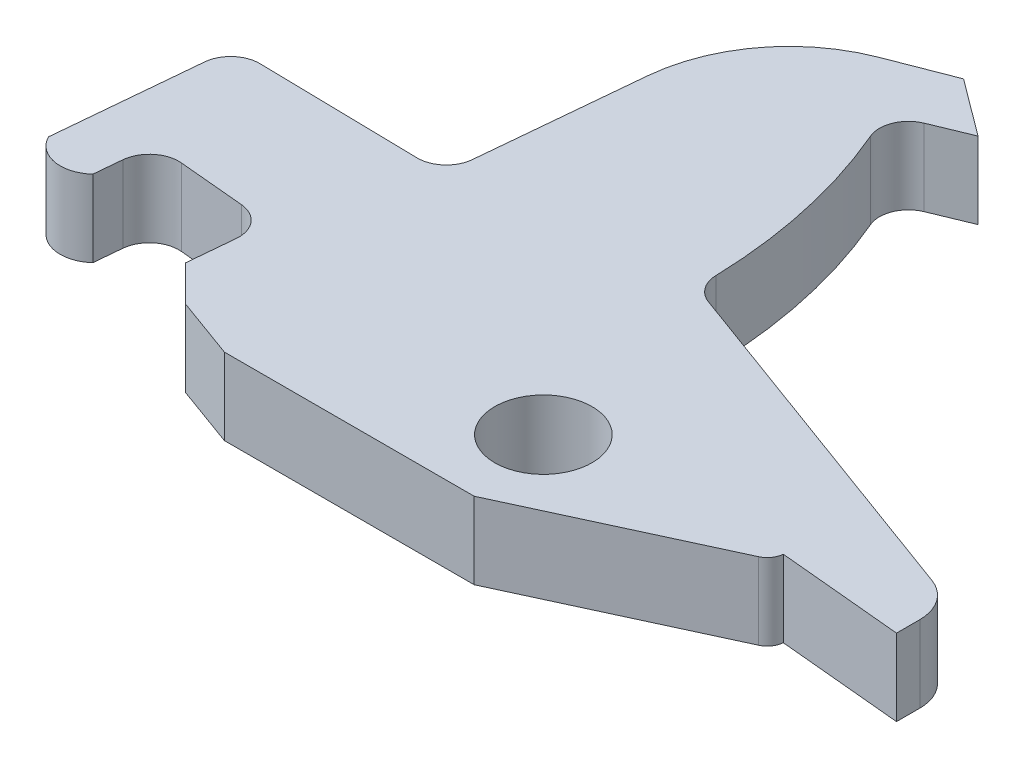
ISO-10303-21;
HEADER;
FILE_DESCRIPTION(('STEP AP214'),'2;1');
FILE_NAME('part.step','',(''),(''),'','','');
FILE_SCHEMA(('AUTOMOTIVE_DESIGN { 1 0 10303 214 1 1 1 1 }'));
ENDSEC;
DATA;
#1=APPLICATION_CONTEXT('core data for automotive mechanical design processes');
#2=APPLICATION_PROTOCOL_DEFINITION('international standard','automotive_design',2000,#1);
#3=PRODUCT_CONTEXT('',#1,'mechanical');
#4=PRODUCT('Part','Part','',(#3));
#5=PRODUCT_RELATED_PRODUCT_CATEGORY('part','',(#4));
#6=PRODUCT_DEFINITION_FORMATION('','',#4);
#7=PRODUCT_DEFINITION_CONTEXT('part definition',#1,'design');
#8=PRODUCT_DEFINITION('design','',#6,#7);
#9=PRODUCT_DEFINITION_SHAPE('','',#8);
#10=(LENGTH_UNIT() NAMED_UNIT(*) SI_UNIT(.MILLI.,.METRE.));
#11=(NAMED_UNIT(*) PLANE_ANGLE_UNIT() SI_UNIT($,.RADIAN.));
#12=(NAMED_UNIT(*) SI_UNIT($,.STERADIAN.) SOLID_ANGLE_UNIT());
#13=UNCERTAINTY_MEASURE_WITH_UNIT(LENGTH_MEASURE(1.E-05),#10,'distance_accuracy_value','');
#14=(GEOMETRIC_REPRESENTATION_CONTEXT(3) GLOBAL_UNCERTAINTY_ASSIGNED_CONTEXT((#13)) GLOBAL_UNIT_ASSIGNED_CONTEXT((#10,
#11,#12)) REPRESENTATION_CONTEXT('',''));
#15=CARTESIAN_POINT('',(0.,0.,0.));
#16=DIRECTION('',(0.,0.,1.));
#17=DIRECTION('',(1.,0.,0.));
#18=AXIS2_PLACEMENT_3D('',#15,#16,#17);
#19=CARTESIAN_POINT('',(33.2381306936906,-3.10575828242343,-4.73504927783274));
#20=DIRECTION('',(0.,1.,0.));
#21=DIRECTION('',(0.,0.,1.));
#22=AXIS2_PLACEMENT_3D('',#19,#20,#21);
#23=CYLINDRICAL_SURFACE('',#22,1.72591142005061);
#24=CARTESIAN_POINT('',(33.2381306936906,0.,-4.73504927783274));
#25=DIRECTION('',(0.,1.,0.));
#26=DIRECTION('',(0.,0.,1.));
#27=AXIS2_PLACEMENT_3D('',#24,#25,#26);
#28=CIRCLE('',#27,1.72591142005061);
#29=CARTESIAN_POINT('',(34.9640421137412,0.,-4.73504927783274));
#30=VERTEX_POINT('',#29);
#31=CARTESIAN_POINT('',(33.8326173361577,0.,-6.35534427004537));
#32=VERTEX_POINT('',#31);
#33=EDGE_CURVE('E245',#30,#32,#28,.T.);
#34=ORIENTED_EDGE('',*,*,#33,.F.);
#35=DIRECTION('',(0.,1.,0.));
#36=VECTOR('',#35,1.);
#37=CARTESIAN_POINT('',(34.9640421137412,-3.10575828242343,-4.73504927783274));
#38=LINE('',#37,#36);
#39=CARTESIAN_POINT('',(34.9640421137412,-3.10575828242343,-4.73504927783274));
#40=VERTEX_POINT('',#39);
#41=EDGE_CURVE('E11',#40,#30,#38,.T.);
#42=ORIENTED_EDGE('',*,*,#41,.F.);
#43=CARTESIAN_POINT('',(33.2381306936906,-3.10575828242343,-4.73504927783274));
#44=DIRECTION('',(0.,1.,0.));
#45=DIRECTION('',(0.,0.,1.));
#46=AXIS2_PLACEMENT_3D('',#43,#44,#45);
#47=CIRCLE('',#46,1.72591142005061);
#48=CARTESIAN_POINT('',(33.8326173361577,-3.10575828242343,-6.35534427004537));
#49=VERTEX_POINT('',#48);
#50=EDGE_CURVE('E323',#40,#49,#47,.T.);
#51=ORIENTED_EDGE('',*,*,#50,.T.);
#52=DIRECTION('',(0.,1.,0.));
#53=VECTOR('',#52,1.);
#54=CARTESIAN_POINT('',(33.8326173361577,-3.10575828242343,-6.35534427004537));
#55=LINE('',#54,#53);
#56=EDGE_CURVE('E37',#49,#32,#55,.T.);
#57=ORIENTED_EDGE('',*,*,#56,.T.);
#58=EDGE_LOOP('',(#34,#42,#51,#57));
#59=FACE_BOUND('',#58,.T.);
#60=ADVANCED_FACE('F34',(#59),#23,.T.);
#61=CARTESIAN_POINT('',(34.9640421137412,-3.10575828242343,-4.73504927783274));
#62=DIRECTION('',(1.,0.,0.));
#63=DIRECTION('',(0.,0.,-1.));
#64=AXIS2_PLACEMENT_3D('',#61,#62,#63);
#65=PLANE('',#64);
#66=DIRECTION('',(0.,0.,-1.));
#67=VECTOR('',#66,1.);
#68=CARTESIAN_POINT('',(34.9640421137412,0.,-4.73504927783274));
#69=LINE('',#68,#67);
#70=CARTESIAN_POINT('',(34.9640421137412,0.,-3.78792750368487));
#71=VERTEX_POINT('',#70);
#72=EDGE_CURVE('E321',#71,#30,#69,.T.);
#73=ORIENTED_EDGE('',*,*,#72,.F.);
#74=DIRECTION('',(0.,1.,0.));
#75=VECTOR('',#74,1.);
#76=CARTESIAN_POINT('',(34.9640421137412,-3.10575828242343,-3.78792750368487));
#77=LINE('',#76,#75);
#78=CARTESIAN_POINT('',(34.9640421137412,-3.10575828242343,-3.78792750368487));
#79=VERTEX_POINT('',#78);
#80=EDGE_CURVE('E43',#79,#71,#77,.T.);
#81=ORIENTED_EDGE('',*,*,#80,.F.);
#82=DIRECTION('',(0.,0.,-1.));
#83=VECTOR('',#82,1.);
#84=CARTESIAN_POINT('',(34.9640421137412,-3.10575828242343,-4.73504927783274));
#85=LINE('',#84,#83);
#86=EDGE_CURVE('E235',#79,#40,#85,.T.);
#87=ORIENTED_EDGE('',*,*,#86,.T.);
#88=ORIENTED_EDGE('',*,*,#41,.T.);
#89=EDGE_LOOP('',(#73,#81,#87,#88));
#90=FACE_BOUND('',#89,.T.);
#91=ADVANCED_FACE('F373',(#90),#65,.T.);
#92=CARTESIAN_POINT('',(29.906313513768,-3.10575828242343,-4.26309211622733));
#93=DIRECTION('',(-0.0935363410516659,0.,0.995615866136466));
#94=DIRECTION('',(0.995615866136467,0.,0.0935363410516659));
#95=AXIS2_PLACEMENT_3D('',#92,#93,#94);
#96=PLANE('',#95);
#97=DIRECTION('',(0.995615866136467,0.,0.0935363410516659));
#98=VECTOR('',#97,1.);
#99=CARTESIAN_POINT('',(29.906313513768,0.,-4.26309211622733));
#100=LINE('',#99,#98);
#101=CARTESIAN_POINT('',(29.906313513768,0.,-4.26309211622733));
#102=VERTEX_POINT('',#101);
#103=EDGE_CURVE('E222',#102,#71,#100,.T.);
#104=ORIENTED_EDGE('',*,*,#103,.F.);
#105=DIRECTION('',(0.,1.,0.));
#106=VECTOR('',#105,1.);
#107=CARTESIAN_POINT('',(29.906313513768,-3.10575828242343,-4.26309211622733));
#108=LINE('',#107,#106);
#109=CARTESIAN_POINT('',(29.906313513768,-3.10575828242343,-4.26309211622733));
#110=VERTEX_POINT('',#109);
#111=EDGE_CURVE('E217',#110,#102,#108,.T.);
#112=ORIENTED_EDGE('',*,*,#111,.F.);
#113=DIRECTION('',(0.995615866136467,0.,0.0935363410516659));
#114=VECTOR('',#113,1.);
#115=CARTESIAN_POINT('',(29.906313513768,-3.10575828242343,-4.26309211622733));
#116=LINE('',#115,#114);
#117=EDGE_CURVE('E220',#110,#79,#116,.T.);
#118=ORIENTED_EDGE('',*,*,#117,.T.);
#119=ORIENTED_EDGE('',*,*,#80,.T.);
#120=EDGE_LOOP('',(#104,#112,#118,#119));
#121=FACE_BOUND('',#120,.T.);
#122=ADVANCED_FACE('F219',(#121),#96,.T.);
#123=CARTESIAN_POINT('',(29.1876126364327,-3.10575828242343,-4.33061278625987));
#124=DIRECTION('',(0.,1.,0.));
#125=DIRECTION('',(0.,0.,1.));
#126=AXIS2_PLACEMENT_3D('',#123,#124,#125);
#127=CYLINDRICAL_SURFACE('',#126,0.721865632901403);
#128=CARTESIAN_POINT('',(29.1876126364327,0.,-4.33061278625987));
#129=DIRECTION('',(0.,1.,0.));
#130=DIRECTION('',(0.,0.,-1.));
#131=AXIS2_PLACEMENT_3D('',#128,#129,#130);
#132=CIRCLE('',#131,0.721865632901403);
#133=CARTESIAN_POINT('',(29.490163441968,0.,-3.67520985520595));
#134=VERTEX_POINT('',#133);
#135=EDGE_CURVE('E318',#134,#102,#132,.T.);
#136=ORIENTED_EDGE('',*,*,#135,.F.);
#137=DIRECTION('',(0.,1.,0.));
#138=VECTOR('',#137,1.);
#139=CARTESIAN_POINT('',(29.490163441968,-3.10575828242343,-3.67520985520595));
#140=LINE('',#139,#138);
#141=CARTESIAN_POINT('',(29.490163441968,-3.10575828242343,-3.67520985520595));
#142=VERTEX_POINT('',#141);
#143=EDGE_CURVE('E227',#142,#134,#140,.T.);
#144=ORIENTED_EDGE('',*,*,#143,.F.);
#145=CARTESIAN_POINT('',(29.1876126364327,-3.10575828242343,-4.33061278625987));
#146=DIRECTION('',(0.,1.,0.));
#147=DIRECTION('',(0.,0.,-1.));
#148=AXIS2_PLACEMENT_3D('',#145,#146,#147);
#149=CIRCLE('',#148,0.721865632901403);
#150=EDGE_CURVE('E233',#142,#110,#149,.T.);
#151=ORIENTED_EDGE('',*,*,#150,.T.);
#152=ORIENTED_EDGE('',*,*,#111,.T.);
#153=EDGE_LOOP('',(#136,#144,#151,#152));
#154=FACE_BOUND('',#153,.T.);
#155=ADVANCED_FACE('F237',(#154),#127,.T.);
#156=CARTESIAN_POINT('',(29.490163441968,-3.10575828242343,-3.67520985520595));
#157=DIRECTION('',(0.419123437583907,0.,0.907929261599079));
#158=DIRECTION('',(0.907929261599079,0.,-0.419123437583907));
#159=AXIS2_PLACEMENT_3D('',#156,#157,#158);
#160=PLANE('',#159);
#161=DIRECTION('',(0.907929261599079,0.,-0.419123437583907));
#162=VECTOR('',#161,1.);
#163=CARTESIAN_POINT('',(29.490163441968,0.,-3.67520985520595));
#164=LINE('',#163,#162);
#165=CARTESIAN_POINT('',(21.608505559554,0.,-0.0368343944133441));
#166=VERTEX_POINT('',#165);
#167=EDGE_CURVE('E315',#166,#134,#164,.T.);
#168=ORIENTED_EDGE('',*,*,#167,.F.);
#169=DIRECTION('',(0.,1.,0.));
#170=VECTOR('',#169,1.);
#171=CARTESIAN_POINT('',(21.608505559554,-3.10575828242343,-0.0368343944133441));
#172=LINE('',#171,#170);
#173=CARTESIAN_POINT('',(21.608505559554,-3.10575828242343,-0.0368343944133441));
#174=VERTEX_POINT('',#173);
#175=EDGE_CURVE('E327',#174,#166,#172,.T.);
#176=ORIENTED_EDGE('',*,*,#175,.F.);
#177=DIRECTION('',(0.907929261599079,0.,-0.419123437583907));
#178=VECTOR('',#177,1.);
#179=CARTESIAN_POINT('',(29.490163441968,-3.10575828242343,-3.67520985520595));
#180=LINE('',#179,#178);
#181=EDGE_CURVE('E238',#174,#142,#180,.T.);
#182=ORIENTED_EDGE('',*,*,#181,.T.);
#183=ORIENTED_EDGE('',*,*,#143,.T.);
#184=EDGE_LOOP('',(#168,#176,#182,#183));
#185=FACE_BOUND('',#184,.T.);
#186=ADVANCED_FACE('F386',(#185),#160,.T.);
#187=CARTESIAN_POINT('',(11.4950564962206,-3.10575828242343,-0.0347412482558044));
#188=DIRECTION('',(0.000206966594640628,0.,0.999999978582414));
#189=DIRECTION('',(0.999999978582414,0.,-0.000206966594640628));
#190=AXIS2_PLACEMENT_3D('',#187,#188,#189);
#191=PLANE('',#190);
#192=DIRECTION('',(0.999999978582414,0.,-0.000206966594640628));
#193=VECTOR('',#192,1.);
#194=CARTESIAN_POINT('',(11.4950564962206,0.,-0.0347412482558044));
#195=LINE('',#194,#193);
#196=CARTESIAN_POINT('',(11.4950564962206,0.,-0.0347412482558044));
#197=VERTEX_POINT('',#196);
#198=EDGE_CURVE('E312',#197,#166,#195,.T.);
#199=ORIENTED_EDGE('',*,*,#198,.F.);
#200=DIRECTION('',(0.,1.,0.));
#201=VECTOR('',#200,1.);
#202=CARTESIAN_POINT('',(11.4950564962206,-3.10575828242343,-0.0347412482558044));
#203=LINE('',#202,#201);
#204=CARTESIAN_POINT('',(11.4950564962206,-3.10575828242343,-0.0347412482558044));
#205=VERTEX_POINT('',#204);
#206=EDGE_CURVE('E329',#205,#197,#203,.T.);
#207=ORIENTED_EDGE('',*,*,#206,.F.);
#208=DIRECTION('',(0.999999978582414,0.,-0.000206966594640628));
#209=VECTOR('',#208,1.);
#210=CARTESIAN_POINT('',(11.4950564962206,-3.10575828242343,-0.0347412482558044));
#211=LINE('',#210,#209);
#212=EDGE_CURVE('E240',#205,#174,#211,.T.);
#213=ORIENTED_EDGE('',*,*,#212,.T.);
#214=ORIENTED_EDGE('',*,*,#175,.T.);
#215=EDGE_LOOP('',(#199,#207,#213,#214));
#216=FACE_BOUND('',#215,.T.);
#217=ADVANCED_FACE('F389',(#216),#191,.T.);
#218=CARTESIAN_POINT('',(9.02702691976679,-3.10575828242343,-0.932452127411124));
#219=DIRECTION('',(-0.34182565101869,0.,0.939763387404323));
#220=DIRECTION('',(0.939763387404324,0.,0.34182565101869));
#221=AXIS2_PLACEMENT_3D('',#218,#219,#220);
#222=PLANE('',#221);
#223=DIRECTION('',(0.939763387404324,0.,0.34182565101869));
#224=VECTOR('',#223,1.);
#225=CARTESIAN_POINT('',(9.02702691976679,0.,-0.932452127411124));
#226=LINE('',#225,#224);
#227=CARTESIAN_POINT('',(9.02702691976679,0.,-0.932452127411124));
#228=VERTEX_POINT('',#227);
#229=EDGE_CURVE('E309',#228,#197,#226,.T.);
#230=ORIENTED_EDGE('',*,*,#229,.F.);
#231=DIRECTION('',(0.,1.,0.));
#232=VECTOR('',#231,1.);
#233=CARTESIAN_POINT('',(9.02702691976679,-3.10575828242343,-0.932452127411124));
#234=LINE('',#233,#232);
#235=CARTESIAN_POINT('',(9.02702691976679,-3.10575828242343,-0.932452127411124));
#236=VERTEX_POINT('',#235);
#237=EDGE_CURVE('E331',#236,#228,#234,.T.);
#238=ORIENTED_EDGE('',*,*,#237,.F.);
#239=DIRECTION('',(0.939763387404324,0.,0.34182565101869));
#240=VECTOR('',#239,1.);
#241=CARTESIAN_POINT('',(9.02702691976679,-3.10575828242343,-0.932452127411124));
#242=LINE('',#241,#240);
#243=EDGE_CURVE('E557',#236,#205,#242,.T.);
#244=ORIENTED_EDGE('',*,*,#243,.T.);
#245=ORIENTED_EDGE('',*,*,#206,.T.);
#246=EDGE_LOOP('',(#230,#238,#244,#245));
#247=FACE_BOUND('',#246,.T.);
#248=ADVANCED_FACE('F393',(#247),#222,.T.);
#249=CARTESIAN_POINT('',(9.02702691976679,-3.10575828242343,-0.932452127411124));
#250=DIRECTION('',(-0.706960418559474,0.,0.707253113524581));
#251=DIRECTION('',(0.707253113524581,0.,0.706960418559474));
#252=AXIS2_PLACEMENT_3D('',#249,#250,#251);
#253=PLANE('',#252);
#254=DIRECTION('',(0.707253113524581,0.,0.706960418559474));
#255=VECTOR('',#254,1.);
#256=CARTESIAN_POINT('',(9.02702691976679,0.,-0.932452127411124));
#257=LINE('',#256,#255);
#258=CARTESIAN_POINT('',(7.57895490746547,0.,-2.3799248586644));
#259=VERTEX_POINT('',#258);
#260=EDGE_CURVE('E306',#259,#228,#257,.T.);
#261=ORIENTED_EDGE('',*,*,#260,.F.);
#262=DIRECTION('',(0.,1.,0.));
#263=VECTOR('',#262,1.);
#264=CARTESIAN_POINT('',(7.57895490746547,-3.10575828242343,-2.3799248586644));
#265=LINE('',#264,#263);
#266=CARTESIAN_POINT('',(7.57895490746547,-3.10575828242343,-2.3799248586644));
#267=VERTEX_POINT('',#266);
#268=EDGE_CURVE('E333',#267,#259,#265,.T.);
#269=ORIENTED_EDGE('',*,*,#268,.F.);
#270=DIRECTION('',(0.707253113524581,0.,0.706960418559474));
#271=VECTOR('',#270,1.);
#272=CARTESIAN_POINT('',(9.02702691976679,-3.10575828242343,-0.932452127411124));
#273=LINE('',#272,#271);
#274=EDGE_CURVE('E554',#267,#236,#273,.T.);
#275=ORIENTED_EDGE('',*,*,#274,.T.);
#276=ORIENTED_EDGE('',*,*,#237,.T.);
#277=EDGE_LOOP('',(#261,#269,#275,#276));
#278=FACE_BOUND('',#277,.T.);
#279=ADVANCED_FACE('F397',(#278),#253,.T.);
#280=CARTESIAN_POINT('',(7.751897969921,-3.10575828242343,-4.25643788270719));
#281=DIRECTION('',(-0.995779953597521,0.,-0.0917730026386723));
#282=DIRECTION('',(-0.0917730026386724,0.,0.995779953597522));
#283=AXIS2_PLACEMENT_3D('',#280,#281,#282);
#284=PLANE('',#283);
#285=DIRECTION('',(-0.0917730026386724,0.,0.995779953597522));
#286=VECTOR('',#285,1.);
#287=CARTESIAN_POINT('',(7.751897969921,0.,-4.25643788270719));
#288=LINE('',#287,#286);
#289=CARTESIAN_POINT('',(7.751897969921,0.,-4.25643788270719));
#290=VERTEX_POINT('',#289);
#291=EDGE_CURVE('E303',#290,#259,#288,.T.);
#292=ORIENTED_EDGE('',*,*,#291,.F.);
#293=DIRECTION('',(0.,1.,0.));
#294=VECTOR('',#293,1.);
#295=CARTESIAN_POINT('',(7.751897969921,-3.10575828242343,-4.25643788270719));
#296=LINE('',#295,#294);
#297=CARTESIAN_POINT('',(7.751897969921,-3.10575828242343,-4.25643788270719));
#298=VERTEX_POINT('',#297);
#299=EDGE_CURVE('E335',#298,#290,#296,.T.);
#300=ORIENTED_EDGE('',*,*,#299,.F.);
#301=DIRECTION('',(-0.0917730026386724,0.,0.995779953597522));
#302=VECTOR('',#301,1.);
#303=CARTESIAN_POINT('',(7.751897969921,-3.10575828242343,-4.25643788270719));
#304=LINE('',#303,#302);
#305=EDGE_CURVE('E551',#298,#267,#304,.T.);
#306=ORIENTED_EDGE('',*,*,#305,.T.);
#307=ORIENTED_EDGE('',*,*,#268,.T.);
#308=EDGE_LOOP('',(#292,#300,#306,#307));
#309=FACE_BOUND('',#308,.T.);
#310=ADVANCED_FACE('F401',(#309),#284,.T.);
#311=CARTESIAN_POINT('',(6.56629746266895,-3.10575828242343,-4.36570511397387));
#312=DIRECTION('',(0.,1.,0.));
#313=DIRECTION('',(0.,0.,1.));
#314=AXIS2_PLACEMENT_3D('',#311,#312,#313);
#315=CYLINDRICAL_SURFACE('',#314,1.190625);
#316=CARTESIAN_POINT('',(6.56629746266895,0.,-4.36570511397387));
#317=DIRECTION('',(0.,-1.,0.));
#318=DIRECTION('',(0.,0.,-1.));
#319=AXIS2_PLACEMENT_3D('',#316,#317,#318);
#320=CIRCLE('',#319,1.190625);
#321=CARTESIAN_POINT('',(6.67556469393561,0.,-5.55130562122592));
#322=VERTEX_POINT('',#321);
#323=EDGE_CURVE('E300',#322,#290,#320,.T.);
#324=ORIENTED_EDGE('',*,*,#323,.F.);
#325=DIRECTION('',(0.,1.,0.));
#326=VECTOR('',#325,1.);
#327=CARTESIAN_POINT('',(6.67556469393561,-3.10575828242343,-5.55130562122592));
#328=LINE('',#327,#326);
#329=CARTESIAN_POINT('',(6.67556469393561,-3.10575828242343,-5.55130562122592));
#330=VERTEX_POINT('',#329);
#331=EDGE_CURVE('E337',#330,#322,#328,.T.);
#332=ORIENTED_EDGE('',*,*,#331,.F.);
#333=CARTESIAN_POINT('',(6.56629746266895,-3.10575828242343,-4.36570511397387));
#334=DIRECTION('',(0.,-1.,0.));
#335=DIRECTION('',(0.,0.,-1.));
#336=AXIS2_PLACEMENT_3D('',#333,#334,#335);
#337=CIRCLE('',#336,1.190625);
#338=EDGE_CURVE('E548',#330,#298,#337,.T.);
#339=ORIENTED_EDGE('',*,*,#338,.T.);
#340=ORIENTED_EDGE('',*,*,#299,.T.);
#341=EDGE_LOOP('',(#324,#332,#339,#340));
#342=FACE_BOUND('',#341,.T.);
#343=ADVANCED_FACE('F405',(#342),#315,.F.);
#344=CARTESIAN_POINT('',(3.98820354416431,-3.10575828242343,-5.79897801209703));
#345=DIRECTION('',(-0.0917730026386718,0.,0.995779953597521));
#346=DIRECTION('',(0.995779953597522,0.,0.0917730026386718));
#347=AXIS2_PLACEMENT_3D('',#344,#345,#346);
#348=PLANE('',#347);
#349=DIRECTION('',(0.995779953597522,0.,0.0917730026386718));
#350=VECTOR('',#349,1.);
#351=CARTESIAN_POINT('',(3.98820354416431,0.,-5.79897801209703));
#352=LINE('',#351,#350);
#353=CARTESIAN_POINT('',(3.98820354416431,0.,-5.79897801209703));
#354=VERTEX_POINT('',#353);
#355=EDGE_CURVE('E297',#354,#322,#352,.T.);
#356=ORIENTED_EDGE('',*,*,#355,.F.);
#357=DIRECTION('',(0.,1.,0.));
#358=VECTOR('',#357,1.);
#359=CARTESIAN_POINT('',(3.98820354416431,-3.10575828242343,-5.79897801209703));
#360=LINE('',#359,#358);
#361=CARTESIAN_POINT('',(3.98820354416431,-3.10575828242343,-5.79897801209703));
#362=VERTEX_POINT('',#361);
#363=EDGE_CURVE('E339',#362,#354,#360,.T.);
#364=ORIENTED_EDGE('',*,*,#363,.F.);
#365=DIRECTION('',(0.995779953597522,0.,0.0917730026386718));
#366=VECTOR('',#365,1.);
#367=CARTESIAN_POINT('',(3.98820354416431,-3.10575828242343,-5.79897801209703));
#368=LINE('',#367,#366);
#369=EDGE_CURVE('E545',#362,#330,#368,.T.);
#370=ORIENTED_EDGE('',*,*,#369,.T.);
#371=ORIENTED_EDGE('',*,*,#331,.T.);
#372=EDGE_LOOP('',(#356,#364,#370,#371));
#373=FACE_BOUND('',#372,.T.);
#374=ADVANCED_FACE('F409',(#373),#348,.T.);
#375=CARTESIAN_POINT('',(3.87893631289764,-3.10575828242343,-4.61337750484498));
#376=DIRECTION('',(0.,1.,0.));
#377=DIRECTION('',(0.,0.,1.));
#378=AXIS2_PLACEMENT_3D('',#375,#376,#377);
#379=CYLINDRICAL_SURFACE('',#378,1.190625);
#380=CARTESIAN_POINT('',(3.87893631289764,0.,-4.61337750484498));
#381=DIRECTION('',(0.,-1.,0.));
#382=DIRECTION('',(0.,0.,-1.));
#383=AXIS2_PLACEMENT_3D('',#380,#381,#382);
#384=CIRCLE('',#383,1.190625);
#385=CARTESIAN_POINT('',(2.69333580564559,0.,-4.72264473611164));
#386=VERTEX_POINT('',#385);
#387=EDGE_CURVE('E294',#386,#354,#384,.T.);
#388=ORIENTED_EDGE('',*,*,#387,.F.);
#389=DIRECTION('',(0.,1.,0.));
#390=VECTOR('',#389,1.);
#391=CARTESIAN_POINT('',(2.69333580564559,-3.10575828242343,-4.72264473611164));
#392=LINE('',#391,#390);
#393=CARTESIAN_POINT('',(2.69333580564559,-3.10575828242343,-4.72264473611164));
#394=VERTEX_POINT('',#393);
#395=EDGE_CURVE('E341',#394,#386,#392,.T.);
#396=ORIENTED_EDGE('',*,*,#395,.F.);
#397=CARTESIAN_POINT('',(3.87893631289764,-3.10575828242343,-4.61337750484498));
#398=DIRECTION('',(0.,-1.,0.));
#399=DIRECTION('',(0.,0.,-1.));
#400=AXIS2_PLACEMENT_3D('',#397,#398,#399);
#401=CIRCLE('',#400,1.190625);
#402=EDGE_CURVE('E542',#394,#362,#401,.T.);
#403=ORIENTED_EDGE('',*,*,#402,.T.);
#404=ORIENTED_EDGE('',*,*,#363,.T.);
#405=EDGE_LOOP('',(#388,#396,#403,#404));
#406=FACE_BOUND('',#405,.T.);
#407=ADVANCED_FACE('F413',(#406),#379,.F.);
#408=CARTESIAN_POINT('',(2.69333580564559,-3.10575828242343,-4.72264473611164));
#409=DIRECTION('',(0.995779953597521,0.,0.0917730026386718));
#410=DIRECTION('',(0.0917730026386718,0.,-0.995779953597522));
#411=AXIS2_PLACEMENT_3D('',#408,#409,#410);
#412=PLANE('',#411);
#413=DIRECTION('',(0.0917730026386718,0.,-0.995779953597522));
#414=VECTOR('',#413,1.);
#415=CARTESIAN_POINT('',(2.69333580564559,0.,-4.72264473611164));
#416=LINE('',#415,#414);
#417=CARTESIAN_POINT('',(2.59118248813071,0.,-3.61423351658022));
#418=VERTEX_POINT('',#417);
#419=EDGE_CURVE('E291',#418,#386,#416,.T.);
#420=ORIENTED_EDGE('',*,*,#419,.F.);
#421=DIRECTION('',(0.,1.,0.));
#422=VECTOR('',#421,1.);
#423=CARTESIAN_POINT('',(2.59118248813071,-3.10575828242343,-3.61423351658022));
#424=LINE('',#423,#422);
#425=CARTESIAN_POINT('',(2.59118248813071,-3.10575828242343,-3.61423351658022));
#426=VERTEX_POINT('',#425);
#427=EDGE_CURVE('E343',#426,#418,#424,.T.);
#428=ORIENTED_EDGE('',*,*,#427,.F.);
#429=DIRECTION('',(0.0917730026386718,0.,-0.995779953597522));
#430=VECTOR('',#429,1.);
#431=CARTESIAN_POINT('',(2.69333580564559,-3.10575828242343,-4.72264473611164));
#432=LINE('',#431,#430);
#433=EDGE_CURVE('E539',#426,#394,#432,.T.);
#434=ORIENTED_EDGE('',*,*,#433,.T.);
#435=ORIENTED_EDGE('',*,*,#395,.T.);
#436=EDGE_LOOP('',(#420,#428,#434,#435));
#437=FACE_BOUND('',#436,.T.);
#438=ADVANCED_FACE('F417',(#437),#412,.T.);
#439=CARTESIAN_POINT('',(1.64081354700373,-3.10575828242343,-4.63721937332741));
#440=DIRECTION('',(0.,1.,0.));
#441=DIRECTION('',(0.,0.,1.));
#442=AXIS2_PLACEMENT_3D('',#439,#440,#441);
#443=CYLINDRICAL_SURFACE('',#442,1.39631700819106);
#444=CARTESIAN_POINT('',(1.64081354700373,0.,-4.63721937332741));
#445=DIRECTION('',(0.,1.,0.));
#446=DIRECTION('',(0.,0.,-1.));
#447=AXIS2_PLACEMENT_3D('',#444,#445,#446);
#448=CIRCLE('',#447,1.39631700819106);
#449=CARTESIAN_POINT('',(0.384605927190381,0.,-4.02759358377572));
#450=VERTEX_POINT('',#449);
#451=EDGE_CURVE('E288',#450,#418,#448,.T.);
#452=ORIENTED_EDGE('',*,*,#451,.F.);
#453=DIRECTION('',(0.,1.,0.));
#454=VECTOR('',#453,1.);
#455=CARTESIAN_POINT('',(0.384605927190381,-3.10575828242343,-4.02759358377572));
#456=LINE('',#455,#454);
#457=CARTESIAN_POINT('',(0.384605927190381,-3.10575828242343,-4.02759358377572));
#458=VERTEX_POINT('',#457);
#459=EDGE_CURVE('E345',#458,#450,#456,.T.);
#460=ORIENTED_EDGE('',*,*,#459,.F.);
#461=CARTESIAN_POINT('',(1.64081354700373,-3.10575828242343,-4.63721937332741));
#462=DIRECTION('',(0.,1.,0.));
#463=DIRECTION('',(0.,0.,-1.));
#464=AXIS2_PLACEMENT_3D('',#461,#462,#463);
#465=CIRCLE('',#464,1.39631700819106);
#466=EDGE_CURVE('E536',#458,#426,#465,.T.);
#467=ORIENTED_EDGE('',*,*,#466,.T.);
#468=ORIENTED_EDGE('',*,*,#427,.T.);
#469=EDGE_LOOP('',(#452,#460,#467,#468));
#470=FACE_BOUND('',#469,.T.);
#471=ADVANCED_FACE('F421',(#470),#443,.T.);
#472=CARTESIAN_POINT('',(0.917649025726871,-3.10575828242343,-9.81136023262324));
#473=DIRECTION('',(-0.995779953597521,0.,-0.0917730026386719));
#474=DIRECTION('',(-0.0917730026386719,0.,0.995779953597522));
#475=AXIS2_PLACEMENT_3D('',#472,#473,#474);
#476=PLANE('',#475);
#477=DIRECTION('',(-0.0917730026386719,0.,0.995779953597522));
#478=VECTOR('',#477,1.);
#479=CARTESIAN_POINT('',(0.917649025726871,0.,-9.81136023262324));
#480=LINE('',#479,#478);
#481=CARTESIAN_POINT('',(0.917649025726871,0.,-9.81136023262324));
#482=VERTEX_POINT('',#481);
#483=EDGE_CURVE('E285',#482,#450,#480,.T.);
#484=ORIENTED_EDGE('',*,*,#483,.F.);
#485=DIRECTION('',(0.,1.,0.));
#486=VECTOR('',#485,1.);
#487=CARTESIAN_POINT('',(0.917649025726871,-3.10575828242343,-9.81136023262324));
#488=LINE('',#487,#486);
#489=CARTESIAN_POINT('',(0.917649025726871,-3.10575828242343,-9.81136023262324));
#490=VERTEX_POINT('',#489);
#491=EDGE_CURVE('E347',#490,#482,#488,.T.);
#492=ORIENTED_EDGE('',*,*,#491,.F.);
#493=DIRECTION('',(-0.0917730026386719,0.,0.995779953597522));
#494=VECTOR('',#493,1.);
#495=CARTESIAN_POINT('',(0.917649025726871,-3.10575828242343,-9.81136023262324));
#496=LINE('',#495,#494);
#497=EDGE_CURVE('E533',#490,#458,#496,.T.);
#498=ORIENTED_EDGE('',*,*,#497,.T.);
#499=ORIENTED_EDGE('',*,*,#459,.T.);
#500=EDGE_LOOP('',(#484,#492,#498,#499));
#501=FACE_BOUND('',#500,.T.);
#502=ADVANCED_FACE('F425',(#501),#476,.T.);
#503=CARTESIAN_POINT('',(2.08111832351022,-3.10575828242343,-9.70413265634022));
#504=DIRECTION('',(0.,1.,0.));
#505=DIRECTION('',(0.,0.,1.));
#506=AXIS2_PLACEMENT_3D('',#503,#504,#505);
#507=CYLINDRICAL_SURFACE('',#506,1.1684);
#508=CARTESIAN_POINT('',(2.08111832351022,0.,-9.70413265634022));
#509=DIRECTION('',(0.,1.,0.));
#510=DIRECTION('',(0.,0.,1.));
#511=AXIS2_PLACEMENT_3D('',#508,#509,#510);
#512=CIRCLE('',#511,1.1684);
#513=CARTESIAN_POINT('',(2.10367290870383,0.,-10.8723149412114));
#514=VERTEX_POINT('',#513);
#515=EDGE_CURVE('E282',#514,#482,#512,.T.);
#516=ORIENTED_EDGE('',*,*,#515,.F.);
#517=DIRECTION('',(0.,1.,0.));
#518=VECTOR('',#517,1.);
#519=CARTESIAN_POINT('',(2.10367290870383,-3.10575828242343,-10.8723149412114));
#520=LINE('',#519,#518);
#521=CARTESIAN_POINT('',(2.10367290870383,-3.10575828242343,-10.8723149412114));
#522=VERTEX_POINT('',#521);
#523=EDGE_CURVE('E349',#522,#514,#520,.T.);
#524=ORIENTED_EDGE('',*,*,#523,.F.);
#525=CARTESIAN_POINT('',(2.08111832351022,-3.10575828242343,-9.70413265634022));
#526=DIRECTION('',(0.,1.,0.));
#527=DIRECTION('',(0.,0.,1.));
#528=AXIS2_PLACEMENT_3D('',#525,#526,#527);
#529=CIRCLE('',#528,1.1684);
#530=EDGE_CURVE('E530',#522,#490,#529,.T.);
#531=ORIENTED_EDGE('',*,*,#530,.T.);
#532=ORIENTED_EDGE('',*,*,#491,.T.);
#533=EDGE_LOOP('',(#516,#524,#531,#532));
#534=FACE_BOUND('',#533,.T.);
#535=ADVANCED_FACE('F429',(#534),#507,.T.);
#536=CARTESIAN_POINT('',(8.57927253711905,-3.10575828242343,-10.7472878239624));
#537=DIRECTION('',(0.0193038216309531,0.,-0.999813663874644));
#538=DIRECTION('',(-0.999813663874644,0.,-0.0193038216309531));
#539=AXIS2_PLACEMENT_3D('',#536,#537,#538);
#540=PLANE('',#539);
#541=DIRECTION('',(-0.999813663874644,0.,-0.0193038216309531));
#542=VECTOR('',#541,1.);
#543=CARTESIAN_POINT('',(8.57927253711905,0.,-10.7472878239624));
#544=LINE('',#543,#542);
#545=CARTESIAN_POINT('',(8.57927253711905,0.,-10.7472878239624));
#546=VERTEX_POINT('',#545);
#547=EDGE_CURVE('E279',#546,#514,#544,.T.);
#548=ORIENTED_EDGE('',*,*,#547,.F.);
#549=DIRECTION('',(0.,1.,0.));
#550=VECTOR('',#549,1.);
#551=CARTESIAN_POINT('',(8.57927253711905,-3.10575828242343,-10.7472878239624));
#552=LINE('',#551,#550);
#553=CARTESIAN_POINT('',(8.57927253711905,-3.10575828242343,-10.7472878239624));
#554=VERTEX_POINT('',#553);
#555=EDGE_CURVE('E351',#554,#546,#552,.T.);
#556=ORIENTED_EDGE('',*,*,#555,.F.);
#557=DIRECTION('',(-0.999813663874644,0.,-0.0193038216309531));
#558=VECTOR('',#557,1.);
#559=CARTESIAN_POINT('',(8.57927253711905,-3.10575828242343,-10.7472878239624));
#560=LINE('',#559,#558);
#561=EDGE_CURVE('E527',#554,#522,#560,.T.);
#562=ORIENTED_EDGE('',*,*,#561,.T.);
#563=ORIENTED_EDGE('',*,*,#523,.T.);
#564=EDGE_LOOP('',(#548,#556,#562,#563));
#565=FACE_BOUND('',#564,.T.);
#566=ADVANCED_FACE('F433',(#565),#540,.T.);
#567=CARTESIAN_POINT('',(8.60182712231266,-3.10575828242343,-11.9154701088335));
#568=DIRECTION('',(0.,1.,0.));
#569=DIRECTION('',(0.,0.,1.));
#570=AXIS2_PLACEMENT_3D('',#567,#568,#569);
#571=CYLINDRICAL_SURFACE('',#570,1.1684);
#572=CARTESIAN_POINT('',(8.60182712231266,0.,-11.9154701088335));
#573=DIRECTION('',(0.,-1.,0.));
#574=DIRECTION('',(0.,0.,1.));
#575=AXIS2_PLACEMENT_3D('',#572,#573,#574);
#576=CIRCLE('',#575,1.1684);
#577=CARTESIAN_POINT('',(9.76510470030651,0.,-11.8061822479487));
#578=VERTEX_POINT('',#577);
#579=EDGE_CURVE('E276',#578,#546,#576,.T.);
#580=ORIENTED_EDGE('',*,*,#579,.F.);
#581=DIRECTION('',(0.,1.,0.));
#582=VECTOR('',#581,1.);
#583=CARTESIAN_POINT('',(9.76510470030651,-3.10575828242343,-11.8061822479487));
#584=LINE('',#583,#582);
#585=CARTESIAN_POINT('',(9.76510470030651,-3.10575828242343,-11.8061822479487));
#586=VERTEX_POINT('',#585);
#587=EDGE_CURVE('E353',#586,#578,#584,.T.);
#588=ORIENTED_EDGE('',*,*,#587,.F.);
#589=CARTESIAN_POINT('',(8.60182712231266,-3.10575828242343,-11.9154701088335));
#590=DIRECTION('',(0.,-1.,0.));
#591=DIRECTION('',(0.,0.,1.));
#592=AXIS2_PLACEMENT_3D('',#589,#590,#591);
#593=CIRCLE('',#592,1.1684);
#594=EDGE_CURVE('E524',#586,#554,#593,.T.);
#595=ORIENTED_EDGE('',*,*,#594,.T.);
#596=ORIENTED_EDGE('',*,*,#555,.T.);
#597=EDGE_LOOP('',(#580,#588,#595,#596));
#598=FACE_BOUND('',#597,.T.);
#599=ADVANCED_FACE('F437',(#598),#571,.F.);
#600=CARTESIAN_POINT('',(10.3749708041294,-3.10575828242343,-18.2976951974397));
#601=DIRECTION('',(-0.995615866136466,0.,-0.0935363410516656));
#602=DIRECTION('',(-0.0935363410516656,0.,0.995615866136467));
#603=AXIS2_PLACEMENT_3D('',#600,#601,#602);
#604=PLANE('',#603);
#605=DIRECTION('',(-0.0935363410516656,0.,0.995615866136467));
#606=VECTOR('',#605,1.);
#607=CARTESIAN_POINT('',(10.3749708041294,0.,-18.2976951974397));
#608=LINE('',#607,#606);
#609=CARTESIAN_POINT('',(10.3749708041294,0.,-18.2976951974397));
#610=VERTEX_POINT('',#609);
#611=EDGE_CURVE('E273',#610,#578,#608,.T.);
#612=ORIENTED_EDGE('',*,*,#611,.F.);
#613=DIRECTION('',(0.,1.,0.));
#614=VECTOR('',#613,1.);
#615=CARTESIAN_POINT('',(10.3749708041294,-3.10575828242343,-18.2976951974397));
#616=LINE('',#615,#614);
#617=CARTESIAN_POINT('',(10.3749708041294,-3.10575828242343,-18.2976951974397));
#618=VERTEX_POINT('',#617);
#619=EDGE_CURVE('E355',#618,#610,#616,.T.);
#620=ORIENTED_EDGE('',*,*,#619,.F.);
#621=DIRECTION('',(-0.0935363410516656,0.,0.995615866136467));
#622=VECTOR('',#621,1.);
#623=CARTESIAN_POINT('',(10.3749708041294,-3.10575828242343,-18.2976951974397));
#624=LINE('',#623,#622);
#625=EDGE_CURVE('E521',#618,#586,#624,.T.);
#626=ORIENTED_EDGE('',*,*,#625,.T.);
#627=ORIENTED_EDGE('',*,*,#587,.T.);
#628=EDGE_LOOP('',(#612,#620,#626,#627));
#629=FACE_BOUND('',#628,.T.);
#630=ADVANCED_FACE('F441',(#629),#604,.T.);
#631=CARTESIAN_POINT('',(16.697131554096,-3.10575828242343,-17.7037394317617));
#632=DIRECTION('',(0.,1.,0.));
#633=DIRECTION('',(0.,0.,1.));
#634=AXIS2_PLACEMENT_3D('',#631,#632,#633);
#635=CYLINDRICAL_SURFACE('',#634,6.35000000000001);
#636=CARTESIAN_POINT('',(16.697131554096,0.,-17.7037394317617));
#637=DIRECTION('',(0.,1.,0.));
#638=DIRECTION('',(0.,0.,-1.));
#639=AXIS2_PLACEMENT_3D('',#636,#637,#638);
#640=CIRCLE('',#639,6.35000000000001);
#641=CARTESIAN_POINT('',(14.4008920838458,0.,-23.6240252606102));
#642=VERTEX_POINT('',#641);
#643=EDGE_CURVE('E270',#642,#610,#640,.T.);
#644=ORIENTED_EDGE('',*,*,#643,.F.);
#645=DIRECTION('',(0.,1.,0.));
#646=VECTOR('',#645,1.);
#647=CARTESIAN_POINT('',(14.4008920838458,-3.10575828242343,-23.6240252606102));
#648=LINE('',#647,#646);
#649=CARTESIAN_POINT('',(14.4008920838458,-3.10575828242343,-23.6240252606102));
#650=VERTEX_POINT('',#649);
#651=EDGE_CURVE('E357',#650,#642,#648,.T.);
#652=ORIENTED_EDGE('',*,*,#651,.F.);
#653=CARTESIAN_POINT('',(16.697131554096,-3.10575828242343,-17.7037394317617));
#654=DIRECTION('',(0.,1.,0.));
#655=DIRECTION('',(0.,0.,-1.));
#656=AXIS2_PLACEMENT_3D('',#653,#654,#655);
#657=CIRCLE('',#656,6.35000000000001);
#658=EDGE_CURVE('E518',#650,#618,#657,.T.);
#659=ORIENTED_EDGE('',*,*,#658,.T.);
#660=ORIENTED_EDGE('',*,*,#619,.T.);
#661=EDGE_LOOP('',(#644,#652,#659,#660));
#662=FACE_BOUND('',#661,.T.);
#663=ADVANCED_FACE('F445',(#662),#635,.T.);
#664=CARTESIAN_POINT('',(14.4008920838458,-3.10575828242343,-23.6240252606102));
#665=DIRECTION('',(-0.361612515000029,0.,-0.932328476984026));
#666=DIRECTION('',(-0.932328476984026,0.,0.361612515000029));
#667=AXIS2_PLACEMENT_3D('',#664,#665,#666);
#668=PLANE('',#667);
#669=DIRECTION('',(-0.932328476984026,0.,0.361612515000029));
#670=VECTOR('',#669,1.);
#671=CARTESIAN_POINT('',(14.4008920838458,0.,-23.6240252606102));
#672=LINE('',#671,#670);
#673=CARTESIAN_POINT('',(16.8828858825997,0.,-24.5866902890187));
#674=VERTEX_POINT('',#673);
#675=EDGE_CURVE('E267',#674,#642,#672,.T.);
#676=ORIENTED_EDGE('',*,*,#675,.F.);
#677=DIRECTION('',(0.,1.,0.));
#678=VECTOR('',#677,1.);
#679=CARTESIAN_POINT('',(16.8828858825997,-3.10575828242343,-24.5866902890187));
#680=LINE('',#679,#678);
#681=CARTESIAN_POINT('',(16.8828858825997,-3.10575828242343,-24.5866902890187));
#682=VERTEX_POINT('',#681);
#683=EDGE_CURVE('E359',#682,#674,#680,.T.);
#684=ORIENTED_EDGE('',*,*,#683,.F.);
#685=DIRECTION('',(-0.932328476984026,0.,0.361612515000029));
#686=VECTOR('',#685,1.);
#687=CARTESIAN_POINT('',(14.4008920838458,-3.10575828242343,-23.6240252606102));
#688=LINE('',#687,#686);
#689=EDGE_CURVE('E515',#682,#650,#688,.T.);
#690=ORIENTED_EDGE('',*,*,#689,.T.);
#691=ORIENTED_EDGE('',*,*,#651,.T.);
#692=EDGE_LOOP('',(#676,#684,#690,#691));
#693=FACE_BOUND('',#692,.T.);
#694=ADVANCED_FACE('F449',(#693),#668,.T.);
#695=CARTESIAN_POINT('',(19.1804182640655,-3.10575828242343,-22.8727154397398));
#696=DIRECTION('',(0.597949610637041,0.,-0.801533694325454));
#697=DIRECTION('',(-0.801533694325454,0.,-0.597949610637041));
#698=AXIS2_PLACEMENT_3D('',#695,#696,#697);
#699=PLANE('',#698);
#700=DIRECTION('',(-0.801533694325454,0.,-0.597949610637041));
#701=VECTOR('',#700,1.);
#702=CARTESIAN_POINT('',(19.1804182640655,0.,-22.8727154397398));
#703=LINE('',#702,#701);
#704=CARTESIAN_POINT('',(19.1804182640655,0.,-22.8727154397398));
#705=VERTEX_POINT('',#704);
#706=EDGE_CURVE('E264',#705,#674,#703,.T.);
#707=ORIENTED_EDGE('',*,*,#706,.F.);
#708=DIRECTION('',(0.,1.,0.));
#709=VECTOR('',#708,1.);
#710=CARTESIAN_POINT('',(19.1804182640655,-3.10575828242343,-22.8727154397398));
#711=LINE('',#710,#709);
#712=CARTESIAN_POINT('',(19.1804182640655,-3.10575828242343,-22.8727154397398));
#713=VERTEX_POINT('',#712);
#714=EDGE_CURVE('E361',#713,#705,#711,.T.);
#715=ORIENTED_EDGE('',*,*,#714,.F.);
#716=DIRECTION('',(-0.801533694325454,0.,-0.597949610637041));
#717=VECTOR('',#716,1.);
#718=CARTESIAN_POINT('',(19.1804182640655,-3.10575828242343,-22.8727154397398));
#719=LINE('',#718,#717);
#720=EDGE_CURVE('E512',#713,#682,#719,.T.);
#721=ORIENTED_EDGE('',*,*,#720,.T.);
#722=ORIENTED_EDGE('',*,*,#683,.T.);
#723=EDGE_LOOP('',(#707,#715,#721,#722));
#724=FACE_BOUND('',#723,.T.);
#725=ADVANCED_FACE('F453',(#724),#699,.T.);
#726=CARTESIAN_POINT('',(17.6335398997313,-3.10575828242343,-22.234670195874));
#727=DIRECTION('',(0.381309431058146,0.,0.924447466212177));
#728=DIRECTION('',(0.924447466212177,0.,-0.381309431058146));
#729=AXIS2_PLACEMENT_3D('',#726,#727,#728);
#730=PLANE('',#729);
#731=DIRECTION('',(0.924447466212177,0.,-0.381309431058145));
#732=VECTOR('',#731,1.);
#733=CARTESIAN_POINT('',(17.6335398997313,0.,-22.234670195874));
#734=LINE('',#733,#732);
#735=CARTESIAN_POINT('',(17.6335398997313,0.,-22.234670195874));
#736=VERTEX_POINT('',#735);
#737=EDGE_CURVE('E261',#736,#705,#734,.T.);
#738=ORIENTED_EDGE('',*,*,#737,.F.);
#739=DIRECTION('',(0.,1.,0.));
#740=VECTOR('',#739,1.);
#741=CARTESIAN_POINT('',(17.6335398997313,-3.10575828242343,-22.234670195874));
#742=LINE('',#741,#740);
#743=CARTESIAN_POINT('',(17.6335398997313,-3.10575828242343,-22.234670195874));
#744=VERTEX_POINT('',#743);
#745=EDGE_CURVE('E363',#744,#736,#742,.T.);
#746=ORIENTED_EDGE('',*,*,#745,.F.);
#747=DIRECTION('',(0.924447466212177,0.,-0.381309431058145));
#748=VECTOR('',#747,1.);
#749=CARTESIAN_POINT('',(17.6335398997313,-3.10575828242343,-22.234670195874));
#750=LINE('',#749,#748);
#751=EDGE_CURVE('E509',#744,#713,#750,.T.);
#752=ORIENTED_EDGE('',*,*,#751,.T.);
#753=ORIENTED_EDGE('',*,*,#714,.T.);
#754=EDGE_LOOP('',(#738,#746,#752,#753));
#755=FACE_BOUND('',#754,.T.);
#756=ADVANCED_FACE('F457',(#755),#730,.T.);
#757=CARTESIAN_POINT('',(18.0790618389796,-3.10575828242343,-21.1545457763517));
#758=DIRECTION('',(0.,1.,0.));
#759=DIRECTION('',(0.,0.,1.));
#760=AXIS2_PLACEMENT_3D('',#757,#758,#759);
#761=CYLINDRICAL_SURFACE('',#760,1.1684);
#762=CARTESIAN_POINT('',(18.0790618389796,0.,-21.1545457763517));
#763=DIRECTION('',(0.,-1.,0.));
#764=DIRECTION('',(0.,0.,1.));
#765=AXIS2_PLACEMENT_3D('',#762,#763,#764);
#766=CIRCLE('',#765,1.1684);
#767=CARTESIAN_POINT('',(17.0051363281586,0.,-20.6942822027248));
#768=VERTEX_POINT('',#767);
#769=EDGE_CURVE('E258',#768,#736,#766,.T.);
#770=ORIENTED_EDGE('',*,*,#769,.F.);
#771=DIRECTION('',(0.,1.,0.));
#772=VECTOR('',#771,1.);
#773=CARTESIAN_POINT('',(17.0051363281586,-3.10575828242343,-20.6942822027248));
#774=LINE('',#773,#772);
#775=CARTESIAN_POINT('',(17.0051363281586,-3.10575828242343,-20.6942822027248));
#776=VERTEX_POINT('',#775);
#777=EDGE_CURVE('E365',#776,#768,#774,.T.);
#778=ORIENTED_EDGE('',*,*,#777,.F.);
#779=CARTESIAN_POINT('',(18.0790618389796,-3.10575828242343,-21.1545457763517));
#780=DIRECTION('',(0.,-1.,0.));
#781=DIRECTION('',(0.,0.,1.));
#782=AXIS2_PLACEMENT_3D('',#779,#780,#781);
#783=CIRCLE('',#782,1.1684);
#784=EDGE_CURVE('E506',#776,#744,#783,.T.);
#785=ORIENTED_EDGE('',*,*,#784,.T.);
#786=ORIENTED_EDGE('',*,*,#745,.T.);
#787=EDGE_LOOP('',(#770,#778,#785,#786));
#788=FACE_BOUND('',#787,.T.);
#789=ADVANCED_FACE('F461',(#788),#761,.F.);
#790=CARTESIAN_POINT('',(-3.0959183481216,-3.10575828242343,-12.079361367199));
#791=DIRECTION('',(0.,1.,0.));
#792=DIRECTION('',(0.,0.,1.));
#793=AXIS2_PLACEMENT_3D('',#790,#791,#792);
#794=CYLINDRICAL_SURFACE('',#793,21.8693680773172);
#795=CARTESIAN_POINT('',(-3.0959183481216,0.,-12.079361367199));
#796=DIRECTION('',(0.,1.,0.));
#797=DIRECTION('',(0.,0.,1.));
#798=AXIS2_PLACEMENT_3D('',#795,#796,#797);
#799=CIRCLE('',#798,21.8693680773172);
#800=CARTESIAN_POINT('',(18.7655252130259,0.,-12.668042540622));
#801=VERTEX_POINT('',#800);
#802=EDGE_CURVE('E255',#801,#768,#799,.T.);
#803=ORIENTED_EDGE('',*,*,#802,.F.);
#804=DIRECTION('',(0.,1.,0.));
#805=VECTOR('',#804,1.);
#806=CARTESIAN_POINT('',(18.7655252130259,-3.10575828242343,-12.668042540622));
#807=LINE('',#806,#805);
#808=CARTESIAN_POINT('',(18.7655252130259,-3.10575828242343,-12.668042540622));
#809=VERTEX_POINT('',#808);
#810=EDGE_CURVE('E367',#809,#801,#807,.T.);
#811=ORIENTED_EDGE('',*,*,#810,.F.);
#812=CARTESIAN_POINT('',(-3.0959183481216,-3.10575828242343,-12.079361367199));
#813=DIRECTION('',(0.,1.,0.));
#814=DIRECTION('',(0.,0.,1.));
#815=AXIS2_PLACEMENT_3D('',#812,#813,#814);
#816=CIRCLE('',#815,21.8693680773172);
#817=EDGE_CURVE('E503',#809,#776,#816,.T.);
#818=ORIENTED_EDGE('',*,*,#817,.T.);
#819=ORIENTED_EDGE('',*,*,#777,.T.);
#820=EDGE_LOOP('',(#803,#811,#818,#819));
#821=FACE_BOUND('',#820,.T.);
#822=ADVANCED_FACE('F465',(#821),#794,.T.);
#823=CARTESIAN_POINT('',(19.9335018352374,-3.10575828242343,-12.699493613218));
#824=DIRECTION('',(0.,1.,0.));
#825=DIRECTION('',(0.,0.,1.));
#826=AXIS2_PLACEMENT_3D('',#823,#824,#825);
#827=CYLINDRICAL_SURFACE('',#826,1.1684);
#828=CARTESIAN_POINT('',(19.9335018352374,0.,-12.699493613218));
#829=DIRECTION('',(0.,-1.,0.));
#830=DIRECTION('',(0.,0.,1.));
#831=AXIS2_PLACEMENT_3D('',#828,#829,#830);
#832=CIRCLE('',#831,1.1684);
#833=CARTESIAN_POINT('',(19.5310488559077,0.,-11.6025933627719));
#834=VERTEX_POINT('',#833);
#835=EDGE_CURVE('E252',#834,#801,#832,.T.);
#836=ORIENTED_EDGE('',*,*,#835,.F.);
#837=DIRECTION('',(0.,1.,0.));
#838=VECTOR('',#837,1.);
#839=CARTESIAN_POINT('',(19.5310488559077,-3.10575828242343,-11.6025933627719));
#840=LINE('',#839,#838);
#841=CARTESIAN_POINT('',(19.5310488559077,-3.10575828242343,-11.6025933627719));
#842=VERTEX_POINT('',#841);
#843=EDGE_CURVE('E368',#842,#834,#840,.T.);
#844=ORIENTED_EDGE('',*,*,#843,.F.);
#845=CARTESIAN_POINT('',(19.9335018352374,-3.10575828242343,-12.699493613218));
#846=DIRECTION('',(0.,-1.,0.));
#847=DIRECTION('',(0.,0.,1.));
#848=AXIS2_PLACEMENT_3D('',#845,#846,#847);
#849=CIRCLE('',#848,1.1684);
#850=EDGE_CURVE('E500',#842,#809,#849,.T.);
#851=ORIENTED_EDGE('',*,*,#850,.T.);
#852=ORIENTED_EDGE('',*,*,#810,.T.);
#853=EDGE_LOOP('',(#836,#844,#851,#852));
#854=FACE_BOUND('',#853,.T.);
#855=ADVANCED_FACE('F469',(#854),#827,.F.);
#856=CARTESIAN_POINT('',(19.5310488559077,-3.10575828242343,-11.6025933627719));
#857=DIRECTION('',(0.344447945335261,0.,-0.938805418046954));
#858=DIRECTION('',(-0.938805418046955,0.,-0.344447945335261));
#859=AXIS2_PLACEMENT_3D('',#856,#857,#858);
#860=PLANE('',#859);
#861=DIRECTION('',(-0.938805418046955,0.,-0.344447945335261));
#862=VECTOR('',#861,1.);
#863=CARTESIAN_POINT('',(19.5310488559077,0.,-11.6025933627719));
#864=LINE('',#863,#862);
#865=EDGE_CURVE('E248',#32,#834,#864,.T.);
#866=ORIENTED_EDGE('',*,*,#865,.F.);
#867=ORIENTED_EDGE('',*,*,#56,.F.);
#868=DIRECTION('',(-0.938805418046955,0.,-0.344447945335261));
#869=VECTOR('',#868,1.);
#870=CARTESIAN_POINT('',(19.5310488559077,-3.10575828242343,-11.6025933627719));
#871=LINE('',#870,#869);
#872=EDGE_CURVE('E498',#49,#842,#871,.T.);
#873=ORIENTED_EDGE('',*,*,#872,.T.);
#874=ORIENTED_EDGE('',*,*,#843,.T.);
#875=EDGE_LOOP('',(#866,#867,#873,#874));
#876=FACE_BOUND('',#875,.T.);
#877=ADVANCED_FACE('F370',(#876),#860,.T.);
#878=CARTESIAN_POINT('',(33.2381306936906,-3.10575828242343,-4.73504927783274));
#879=DIRECTION('',(0.,1.,0.));
#880=DIRECTION('',(0.,0.,1.));
#881=AXIS2_PLACEMENT_3D('',#878,#879,#880);
#882=PLANE('',#881);
#883=CARTESIAN_POINT('',(20.8523676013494,-3.10575828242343,-3.59739877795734));
#884=DIRECTION('',(0.,1.,0.));
#885=DIRECTION('',(0.,0.,1.));
#886=AXIS2_PLACEMENT_3D('',#883,#884,#885);
#887=CIRCLE('',#886,1.97167835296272);
#888=CARTESIAN_POINT('',(20.8523676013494,-3.10575828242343,-1.62572042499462));
#889=VERTEX_POINT('',#888);
#890=EDGE_CURVE('E249',#889,#889,#887,.T.);
#891=ORIENTED_EDGE('',*,*,#890,.T.);
#892=EDGE_LOOP('',(#891));
#893=FACE_BOUND('',#892,.T.);
#894=ORIENTED_EDGE('',*,*,#50,.F.);
#895=ORIENTED_EDGE('',*,*,#86,.F.);
#896=ORIENTED_EDGE('',*,*,#117,.F.);
#897=ORIENTED_EDGE('',*,*,#150,.F.);
#898=ORIENTED_EDGE('',*,*,#181,.F.);
#899=ORIENTED_EDGE('',*,*,#212,.F.);
#900=ORIENTED_EDGE('',*,*,#243,.F.);
#901=ORIENTED_EDGE('',*,*,#274,.F.);
#902=ORIENTED_EDGE('',*,*,#305,.F.);
#903=ORIENTED_EDGE('',*,*,#338,.F.);
#904=ORIENTED_EDGE('',*,*,#369,.F.);
#905=ORIENTED_EDGE('',*,*,#402,.F.);
#906=ORIENTED_EDGE('',*,*,#433,.F.);
#907=ORIENTED_EDGE('',*,*,#466,.F.);
#908=ORIENTED_EDGE('',*,*,#497,.F.);
#909=ORIENTED_EDGE('',*,*,#530,.F.);
#910=ORIENTED_EDGE('',*,*,#561,.F.);
#911=ORIENTED_EDGE('',*,*,#594,.F.);
#912=ORIENTED_EDGE('',*,*,#625,.F.);
#913=ORIENTED_EDGE('',*,*,#658,.F.);
#914=ORIENTED_EDGE('',*,*,#689,.F.);
#915=ORIENTED_EDGE('',*,*,#720,.F.);
#916=ORIENTED_EDGE('',*,*,#751,.F.);
#917=ORIENTED_EDGE('',*,*,#784,.F.);
#918=ORIENTED_EDGE('',*,*,#817,.F.);
#919=ORIENTED_EDGE('',*,*,#850,.F.);
#920=ORIENTED_EDGE('',*,*,#872,.F.);
#921=EDGE_LOOP('',(#894,#895,#896,#897,#898,#899,#900,#901,#902,#903,#904,#905,#906,#907,#908,
#909,#910,#911,#912,#913,#914,#915,#916,#917,#918,#919,#920));
#922=FACE_BOUND('',#921,.T.);
#923=ADVANCED_FACE('F231',(#893,#922),#882,.F.);
#924=CARTESIAN_POINT('',(33.2381306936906,0.,-4.73504927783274));
#925=DIRECTION('',(0.,1.,0.));
#926=DIRECTION('',(0.,0.,1.));
#927=AXIS2_PLACEMENT_3D('',#924,#925,#926);
#928=PLANE('',#927);
#929=CARTESIAN_POINT('',(20.8523676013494,0.,-3.59739877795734));
#930=DIRECTION('',(0.,1.,0.));
#931=DIRECTION('',(0.,0.,1.));
#932=AXIS2_PLACEMENT_3D('',#929,#930,#931);
#933=CIRCLE('',#932,1.97167835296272);
#934=CARTESIAN_POINT('',(20.8523676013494,0.,-1.62572042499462));
#935=VERTEX_POINT('',#934);
#936=EDGE_CURVE('E493',#935,#935,#933,.T.);
#937=ORIENTED_EDGE('',*,*,#936,.F.);
#938=EDGE_LOOP('',(#937));
#939=FACE_BOUND('',#938,.T.);
#940=ORIENTED_EDGE('',*,*,#33,.T.);
#941=ORIENTED_EDGE('',*,*,#865,.T.);
#942=ORIENTED_EDGE('',*,*,#835,.T.);
#943=ORIENTED_EDGE('',*,*,#802,.T.);
#944=ORIENTED_EDGE('',*,*,#769,.T.);
#945=ORIENTED_EDGE('',*,*,#737,.T.);
#946=ORIENTED_EDGE('',*,*,#706,.T.);
#947=ORIENTED_EDGE('',*,*,#675,.T.);
#948=ORIENTED_EDGE('',*,*,#643,.T.);
#949=ORIENTED_EDGE('',*,*,#611,.T.);
#950=ORIENTED_EDGE('',*,*,#579,.T.);
#951=ORIENTED_EDGE('',*,*,#547,.T.);
#952=ORIENTED_EDGE('',*,*,#515,.T.);
#953=ORIENTED_EDGE('',*,*,#483,.T.);
#954=ORIENTED_EDGE('',*,*,#451,.T.);
#955=ORIENTED_EDGE('',*,*,#419,.T.);
#956=ORIENTED_EDGE('',*,*,#387,.T.);
#957=ORIENTED_EDGE('',*,*,#355,.T.);
#958=ORIENTED_EDGE('',*,*,#323,.T.);
#959=ORIENTED_EDGE('',*,*,#291,.T.);
#960=ORIENTED_EDGE('',*,*,#260,.T.);
#961=ORIENTED_EDGE('',*,*,#229,.T.);
#962=ORIENTED_EDGE('',*,*,#198,.T.);
#963=ORIENTED_EDGE('',*,*,#167,.T.);
#964=ORIENTED_EDGE('',*,*,#135,.T.);
#965=ORIENTED_EDGE('',*,*,#103,.T.);
#966=ORIENTED_EDGE('',*,*,#72,.T.);
#967=EDGE_LOOP('',(#940,#941,#942,#943,#944,#945,#946,#947,#948,#949,#950,#951,#952,#953,#954,
#955,#956,#957,#958,#959,#960,#961,#962,#963,#964,#965,#966));
#968=FACE_BOUND('',#967,.T.);
#969=ADVANCED_FACE('F372',(#939,#968),#928,.T.);
#970=CARTESIAN_POINT('',(20.8523676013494,-3.10575828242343,-3.59739877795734));
#971=DIRECTION('',(0.,1.,0.));
#972=DIRECTION('',(0.,0.,1.));
#973=AXIS2_PLACEMENT_3D('',#970,#971,#972);
#974=CYLINDRICAL_SURFACE('',#973,1.97167835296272);
#975=ORIENTED_EDGE('',*,*,#890,.F.);
#976=EDGE_LOOP('',(#975));
#977=FACE_BOUND('',#976,.T.);
#978=ORIENTED_EDGE('',*,*,#936,.T.);
#979=EDGE_LOOP('',(#978));
#980=FACE_BOUND('',#979,.T.);
#981=ADVANCED_FACE('F481',(#977,#980),#974,.F.);
#982=CLOSED_SHELL('',(#60,#91,#122,#155,#186,#217,#248,#279,#310,#343,#374,#407,#438,#471,#502,
#535,#566,#599,#630,#663,#694,#725,#756,#789,#822,#855,#877,#923,#969,#981));
#983=MANIFOLD_SOLID_BREP('B2',#982);
#984=ADVANCED_BREP_SHAPE_REPRESENTATION('',(#18,#983),#14);
#985=SHAPE_DEFINITION_REPRESENTATION(#9,#984);
ENDSEC;
END-ISO-10303-21;
